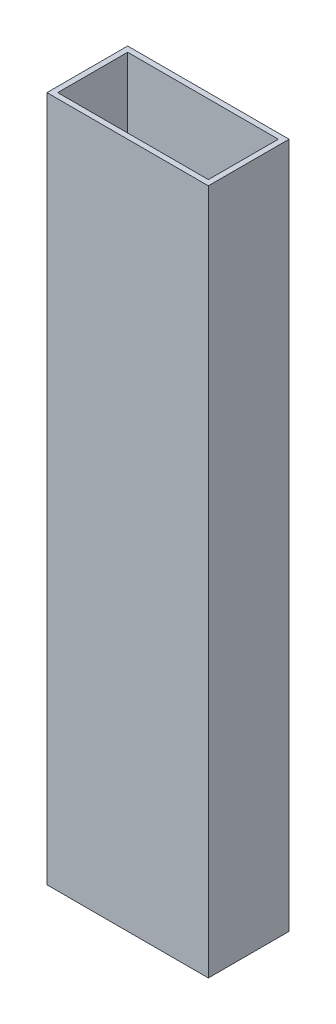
ISO-10303-21;
HEADER;
FILE_DESCRIPTION(('STEP AP214'),'2;1');
FILE_NAME('part.step','',(''),(''),'','','');
FILE_SCHEMA(('AUTOMOTIVE_DESIGN { 1 0 10303 214 1 1 1 1 }'));
ENDSEC;
DATA;
#1=APPLICATION_CONTEXT('core data for automotive mechanical design processes');
#2=APPLICATION_PROTOCOL_DEFINITION('international standard','automotive_design',2000,#1);
#3=PRODUCT_CONTEXT('',#1,'mechanical');
#4=PRODUCT('Part','Part','',(#3));
#5=PRODUCT_RELATED_PRODUCT_CATEGORY('part','',(#4));
#6=PRODUCT_DEFINITION_FORMATION('','',#4);
#7=PRODUCT_DEFINITION_CONTEXT('part definition',#1,'design');
#8=PRODUCT_DEFINITION('design','',#6,#7);
#9=PRODUCT_DEFINITION_SHAPE('','',#8);
#10=(LENGTH_UNIT() NAMED_UNIT(*) SI_UNIT(.MILLI.,.METRE.));
#11=(NAMED_UNIT(*) PLANE_ANGLE_UNIT() SI_UNIT($,.RADIAN.));
#12=(NAMED_UNIT(*) SI_UNIT($,.STERADIAN.) SOLID_ANGLE_UNIT());
#13=UNCERTAINTY_MEASURE_WITH_UNIT(LENGTH_MEASURE(1.E-05),#10,'distance_accuracy_value','');
#14=(GEOMETRIC_REPRESENTATION_CONTEXT(3) GLOBAL_UNCERTAINTY_ASSIGNED_CONTEXT((#13)) GLOBAL_UNIT_ASSIGNED_CONTEXT((#10,
#11,#12)) REPRESENTATION_CONTEXT('',''));
#15=CARTESIAN_POINT('',(0.,0.,0.));
#16=DIRECTION('',(0.,0.,1.));
#17=DIRECTION('',(1.,0.,0.));
#18=AXIS2_PLACEMENT_3D('',#15,#16,#17);
#19=CARTESIAN_POINT('',(0.,255.,0.));
#20=DIRECTION('',(0.,1.,0.));
#21=DIRECTION('',(0.,0.,1.));
#22=AXIS2_PLACEMENT_3D('',#19,#20,#21);
#23=PLANE('',#22);
#24=DIRECTION('',(0.,0.,1.));
#25=VECTOR('',#24,1.);
#26=CARTESIAN_POINT('',(-30.,255.,-15.));
#27=LINE('',#26,#25);
#28=CARTESIAN_POINT('',(-30.,255.,-15.));
#29=VERTEX_POINT('',#28);
#30=CARTESIAN_POINT('',(-30.,255.,15.));
#31=VERTEX_POINT('',#30);
#32=EDGE_CURVE('E159',#29,#31,#27,.T.);
#33=ORIENTED_EDGE('',*,*,#32,.T.);
#34=DIRECTION('',(1.,0.,0.));
#35=VECTOR('',#34,1.);
#36=CARTESIAN_POINT('',(-30.,255.,15.));
#37=LINE('',#36,#35);
#38=CARTESIAN_POINT('',(30.,255.,15.));
#39=VERTEX_POINT('',#38);
#40=EDGE_CURVE('E163',#31,#39,#37,.T.);
#41=ORIENTED_EDGE('',*,*,#40,.T.);
#42=DIRECTION('',(0.,0.,-1.));
#43=VECTOR('',#42,1.);
#44=CARTESIAN_POINT('',(30.,255.,-15.));
#45=LINE('',#44,#43);
#46=CARTESIAN_POINT('',(30.,255.,-15.));
#47=VERTEX_POINT('',#46);
#48=EDGE_CURVE('E167',#39,#47,#45,.T.);
#49=ORIENTED_EDGE('',*,*,#48,.T.);
#50=DIRECTION('',(-1.,0.,0.));
#51=VECTOR('',#50,1.);
#52=CARTESIAN_POINT('',(-30.,255.,-15.));
#53=LINE('',#52,#51);
#54=EDGE_CURVE('E170',#47,#29,#53,.T.);
#55=ORIENTED_EDGE('',*,*,#54,.T.);
#56=EDGE_LOOP('',(#33,#41,#49,#55));
#57=FACE_BOUND('',#56,.T.);
#58=DIRECTION('',(1.,0.,0.));
#59=VECTOR('',#58,1.);
#60=CARTESIAN_POINT('',(-28.,255.,13.));
#61=LINE('',#60,#59);
#62=CARTESIAN_POINT('',(-28.,255.,13.));
#63=VERTEX_POINT('',#62);
#64=CARTESIAN_POINT('',(28.,255.,13.));
#65=VERTEX_POINT('',#64);
#66=EDGE_CURVE('E120',#63,#65,#61,.T.);
#67=ORIENTED_EDGE('',*,*,#66,.F.);
#68=DIRECTION('',(0.,0.,1.));
#69=VECTOR('',#68,1.);
#70=CARTESIAN_POINT('',(-28.,255.,-13.));
#71=LINE('',#70,#69);
#72=CARTESIAN_POINT('',(-28.,255.,-13.));
#73=VERTEX_POINT('',#72);
#74=EDGE_CURVE('E111',#73,#63,#71,.T.);
#75=ORIENTED_EDGE('',*,*,#74,.F.);
#76=DIRECTION('',(-1.,0.,0.));
#77=VECTOR('',#76,1.);
#78=CARTESIAN_POINT('',(-28.,255.,-13.));
#79=LINE('',#78,#77);
#80=CARTESIAN_POINT('',(28.,255.,-13.));
#81=VERTEX_POINT('',#80);
#82=EDGE_CURVE('E137',#81,#73,#79,.T.);
#83=ORIENTED_EDGE('',*,*,#82,.F.);
#84=DIRECTION('',(0.,0.,-1.));
#85=VECTOR('',#84,1.);
#86=CARTESIAN_POINT('',(28.,255.,-13.));
#87=LINE('',#86,#85);
#88=EDGE_CURVE('E133',#65,#81,#87,.T.);
#89=ORIENTED_EDGE('',*,*,#88,.F.);
#90=EDGE_LOOP('',(#67,#75,#83,#89));
#91=FACE_BOUND('',#90,.T.);
#92=ADVANCED_FACE('F45',(#57,#91),#23,.T.);
#93=CARTESIAN_POINT('',(0.,0.,0.));
#94=DIRECTION('',(0.,1.,0.));
#95=DIRECTION('',(0.,0.,1.));
#96=AXIS2_PLACEMENT_3D('',#93,#94,#95);
#97=PLANE('',#96);
#98=DIRECTION('',(0.,0.,1.));
#99=VECTOR('',#98,1.);
#100=CARTESIAN_POINT('',(-30.,0.,-15.));
#101=LINE('',#100,#99);
#102=CARTESIAN_POINT('',(-30.,0.,-15.));
#103=VERTEX_POINT('',#102);
#104=CARTESIAN_POINT('',(-30.,0.,15.));
#105=VERTEX_POINT('',#104);
#106=EDGE_CURVE('E129',#103,#105,#101,.T.);
#107=ORIENTED_EDGE('',*,*,#106,.F.);
#108=DIRECTION('',(-1.,0.,0.));
#109=VECTOR('',#108,1.);
#110=CARTESIAN_POINT('',(-30.,0.,-15.));
#111=LINE('',#110,#109);
#112=CARTESIAN_POINT('',(30.,0.,-15.));
#113=VERTEX_POINT('',#112);
#114=EDGE_CURVE('E164',#113,#103,#111,.T.);
#115=ORIENTED_EDGE('',*,*,#114,.F.);
#116=DIRECTION('',(0.,0.,-1.));
#117=VECTOR('',#116,1.);
#118=CARTESIAN_POINT('',(30.,0.,-15.));
#119=LINE('',#118,#117);
#120=CARTESIAN_POINT('',(30.,0.,15.));
#121=VERTEX_POINT('',#120);
#122=EDGE_CURVE('E180',#121,#113,#119,.T.);
#123=ORIENTED_EDGE('',*,*,#122,.F.);
#124=DIRECTION('',(1.,0.,0.));
#125=VECTOR('',#124,1.);
#126=CARTESIAN_POINT('',(-30.,0.,15.));
#127=LINE('',#126,#125);
#128=EDGE_CURVE('E177',#105,#121,#127,.T.);
#129=ORIENTED_EDGE('',*,*,#128,.F.);
#130=EDGE_LOOP('',(#107,#115,#123,#129));
#131=FACE_BOUND('',#130,.T.);
#132=DIRECTION('',(0.,0.,1.));
#133=VECTOR('',#132,1.);
#134=CARTESIAN_POINT('',(-28.,0.,-13.));
#135=LINE('',#134,#133);
#136=CARTESIAN_POINT('',(-28.,0.,-13.));
#137=VERTEX_POINT('',#136);
#138=CARTESIAN_POINT('',(-28.,0.,13.));
#139=VERTEX_POINT('',#138);
#140=EDGE_CURVE('E69',#137,#139,#135,.T.);
#141=ORIENTED_EDGE('',*,*,#140,.T.);
#142=DIRECTION('',(1.,0.,0.));
#143=VECTOR('',#142,1.);
#144=CARTESIAN_POINT('',(-28.,0.,13.));
#145=LINE('',#144,#143);
#146=CARTESIAN_POINT('',(28.,0.,13.));
#147=VERTEX_POINT('',#146);
#148=EDGE_CURVE('E127',#139,#147,#145,.T.);
#149=ORIENTED_EDGE('',*,*,#148,.T.);
#150=DIRECTION('',(0.,0.,-1.));
#151=VECTOR('',#150,1.);
#152=CARTESIAN_POINT('',(28.,0.,-13.));
#153=LINE('',#152,#151);
#154=CARTESIAN_POINT('',(28.,0.,-13.));
#155=VERTEX_POINT('',#154);
#156=EDGE_CURVE('E146',#147,#155,#153,.T.);
#157=ORIENTED_EDGE('',*,*,#156,.T.);
#158=DIRECTION('',(-1.,0.,0.));
#159=VECTOR('',#158,1.);
#160=CARTESIAN_POINT('',(-28.,0.,-13.));
#161=LINE('',#160,#159);
#162=EDGE_CURVE('E121',#155,#137,#161,.T.);
#163=ORIENTED_EDGE('',*,*,#162,.T.);
#164=EDGE_LOOP('',(#141,#149,#157,#163));
#165=FACE_BOUND('',#164,.T.);
#166=ADVANCED_FACE('F203',(#131,#165),#97,.F.);
#167=CARTESIAN_POINT('',(-30.,255.,-15.));
#168=DIRECTION('',(1.,0.,0.));
#169=DIRECTION('',(0.,0.,-1.));
#170=AXIS2_PLACEMENT_3D('',#167,#168,#169);
#171=PLANE('',#170);
#172=ORIENTED_EDGE('',*,*,#106,.T.);
#173=DIRECTION('',(0.,-1.,0.));
#174=VECTOR('',#173,1.);
#175=CARTESIAN_POINT('',(-30.,255.,15.));
#176=LINE('',#175,#174);
#177=EDGE_CURVE('E11',#31,#105,#176,.T.);
#178=ORIENTED_EDGE('',*,*,#177,.F.);
#179=ORIENTED_EDGE('',*,*,#32,.F.);
#180=DIRECTION('',(0.,-1.,0.));
#181=VECTOR('',#180,1.);
#182=CARTESIAN_POINT('',(-30.,255.,-15.));
#183=LINE('',#182,#181);
#184=EDGE_CURVE('E173',#29,#103,#183,.T.);
#185=ORIENTED_EDGE('',*,*,#184,.T.);
#186=EDGE_LOOP('',(#172,#178,#179,#185));
#187=FACE_BOUND('',#186,.T.);
#188=ADVANCED_FACE('F47',(#187),#171,.F.);
#189=CARTESIAN_POINT('',(-30.,255.,15.));
#190=DIRECTION('',(0.,0.,-1.));
#191=DIRECTION('',(-1.,0.,0.));
#192=AXIS2_PLACEMENT_3D('',#189,#190,#191);
#193=PLANE('',#192);
#194=ORIENTED_EDGE('',*,*,#128,.T.);
#195=DIRECTION('',(0.,-1.,0.));
#196=VECTOR('',#195,1.);
#197=CARTESIAN_POINT('',(30.,255.,15.));
#198=LINE('',#197,#196);
#199=EDGE_CURVE('E54',#39,#121,#198,.T.);
#200=ORIENTED_EDGE('',*,*,#199,.F.);
#201=ORIENTED_EDGE('',*,*,#40,.F.);
#202=ORIENTED_EDGE('',*,*,#177,.T.);
#203=EDGE_LOOP('',(#194,#200,#201,#202));
#204=FACE_BOUND('',#203,.T.);
#205=ADVANCED_FACE('F213',(#204),#193,.F.);
#206=CARTESIAN_POINT('',(30.,255.,-15.));
#207=DIRECTION('',(-1.,0.,0.));
#208=DIRECTION('',(0.,0.,1.));
#209=AXIS2_PLACEMENT_3D('',#206,#207,#208);
#210=PLANE('',#209);
#211=ORIENTED_EDGE('',*,*,#122,.T.);
#212=DIRECTION('',(0.,-1.,0.));
#213=VECTOR('',#212,1.);
#214=CARTESIAN_POINT('',(30.,255.,-15.));
#215=LINE('',#214,#213);
#216=EDGE_CURVE('E188',#47,#113,#215,.T.);
#217=ORIENTED_EDGE('',*,*,#216,.F.);
#218=ORIENTED_EDGE('',*,*,#48,.F.);
#219=ORIENTED_EDGE('',*,*,#199,.T.);
#220=EDGE_LOOP('',(#211,#217,#218,#219));
#221=FACE_BOUND('',#220,.T.);
#222=ADVANCED_FACE('F197',(#221),#210,.F.);
#223=CARTESIAN_POINT('',(-30.,255.,-15.));
#224=DIRECTION('',(0.,0.,1.));
#225=DIRECTION('',(1.,0.,0.));
#226=AXIS2_PLACEMENT_3D('',#223,#224,#225);
#227=PLANE('',#226);
#228=ORIENTED_EDGE('',*,*,#114,.T.);
#229=ORIENTED_EDGE('',*,*,#184,.F.);
#230=ORIENTED_EDGE('',*,*,#54,.F.);
#231=ORIENTED_EDGE('',*,*,#216,.T.);
#232=EDGE_LOOP('',(#228,#229,#230,#231));
#233=FACE_BOUND('',#232,.T.);
#234=ADVANCED_FACE('F207',(#233),#227,.F.);
#235=CARTESIAN_POINT('',(-28.,255.,-13.));
#236=DIRECTION('',(1.,0.,0.));
#237=DIRECTION('',(0.,0.,-1.));
#238=AXIS2_PLACEMENT_3D('',#235,#236,#237);
#239=PLANE('',#238);
#240=ORIENTED_EDGE('',*,*,#140,.F.);
#241=DIRECTION('',(0.,-1.,0.));
#242=VECTOR('',#241,1.);
#243=CARTESIAN_POINT('',(-28.,255.,-13.));
#244=LINE('',#243,#242);
#245=EDGE_CURVE('E115',#73,#137,#244,.T.);
#246=ORIENTED_EDGE('',*,*,#245,.F.);
#247=ORIENTED_EDGE('',*,*,#74,.T.);
#248=DIRECTION('',(0.,-1.,0.));
#249=VECTOR('',#248,1.);
#250=CARTESIAN_POINT('',(-28.,255.,13.));
#251=LINE('',#250,#249);
#252=EDGE_CURVE('E114',#63,#139,#251,.T.);
#253=ORIENTED_EDGE('',*,*,#252,.T.);
#254=EDGE_LOOP('',(#240,#246,#247,#253));
#255=FACE_BOUND('',#254,.T.);
#256=ADVANCED_FACE('F113',(#255),#239,.T.);
#257=CARTESIAN_POINT('',(-28.,255.,13.));
#258=DIRECTION('',(0.,0.,-1.));
#259=DIRECTION('',(-1.,0.,0.));
#260=AXIS2_PLACEMENT_3D('',#257,#258,#259);
#261=PLANE('',#260);
#262=ORIENTED_EDGE('',*,*,#148,.F.);
#263=ORIENTED_EDGE('',*,*,#252,.F.);
#264=ORIENTED_EDGE('',*,*,#66,.T.);
#265=DIRECTION('',(0.,-1.,0.));
#266=VECTOR('',#265,1.);
#267=CARTESIAN_POINT('',(28.,255.,13.));
#268=LINE('',#267,#266);
#269=EDGE_CURVE('E130',#65,#147,#268,.T.);
#270=ORIENTED_EDGE('',*,*,#269,.T.);
#271=EDGE_LOOP('',(#262,#263,#264,#270));
#272=FACE_BOUND('',#271,.T.);
#273=ADVANCED_FACE('F124',(#272),#261,.T.);
#274=CARTESIAN_POINT('',(28.,255.,-13.));
#275=DIRECTION('',(-1.,0.,0.));
#276=DIRECTION('',(0.,0.,1.));
#277=AXIS2_PLACEMENT_3D('',#274,#275,#276);
#278=PLANE('',#277);
#279=ORIENTED_EDGE('',*,*,#156,.F.);
#280=ORIENTED_EDGE('',*,*,#269,.F.);
#281=ORIENTED_EDGE('',*,*,#88,.T.);
#282=DIRECTION('',(0.,-1.,0.));
#283=VECTOR('',#282,1.);
#284=CARTESIAN_POINT('',(28.,255.,-13.));
#285=LINE('',#284,#283);
#286=EDGE_CURVE('E61',#81,#155,#285,.T.);
#287=ORIENTED_EDGE('',*,*,#286,.T.);
#288=EDGE_LOOP('',(#279,#280,#281,#287));
#289=FACE_BOUND('',#288,.T.);
#290=ADVANCED_FACE('F236',(#289),#278,.T.);
#291=CARTESIAN_POINT('',(-28.,255.,-13.));
#292=DIRECTION('',(0.,0.,1.));
#293=DIRECTION('',(1.,0.,0.));
#294=AXIS2_PLACEMENT_3D('',#291,#292,#293);
#295=PLANE('',#294);
#296=ORIENTED_EDGE('',*,*,#162,.F.);
#297=ORIENTED_EDGE('',*,*,#286,.F.);
#298=ORIENTED_EDGE('',*,*,#82,.T.);
#299=ORIENTED_EDGE('',*,*,#245,.T.);
#300=EDGE_LOOP('',(#296,#297,#298,#299));
#301=FACE_BOUND('',#300,.T.);
#302=ADVANCED_FACE('F240',(#301),#295,.T.);
#303=CLOSED_SHELL('',(#92,#166,#188,#205,#222,#234,#256,#273,#290,#302));
#304=MANIFOLD_SOLID_BREP('B2',#303);
#305=ADVANCED_BREP_SHAPE_REPRESENTATION('',(#18,#304),#14);
#306=SHAPE_DEFINITION_REPRESENTATION(#9,#305);
ENDSEC;
END-ISO-10303-21;
